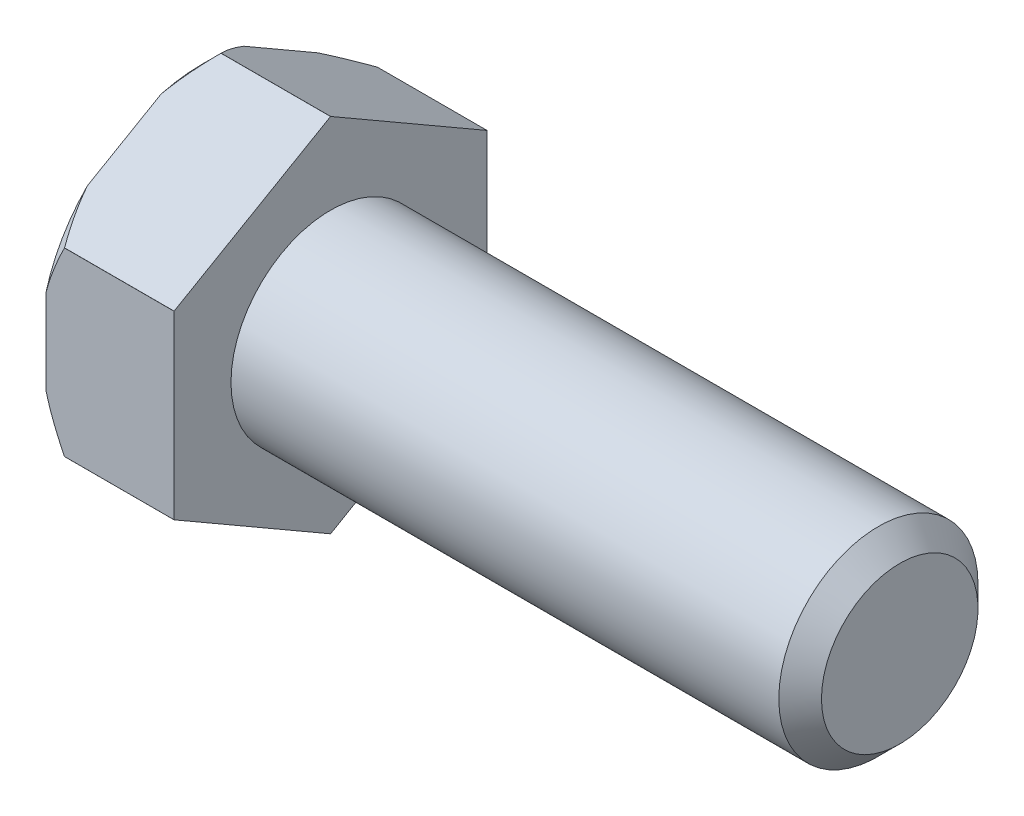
ISO-10303-21;
HEADER;
FILE_DESCRIPTION(('STEP AP214'),'2;1');
FILE_NAME('part.step','',(''),(''),'','','');
FILE_SCHEMA(('AUTOMOTIVE_DESIGN { 1 0 10303 214 1 1 1 1 }'));
ENDSEC;
DATA;
#1=APPLICATION_CONTEXT('core data for automotive mechanical design processes');
#2=APPLICATION_PROTOCOL_DEFINITION('international standard','automotive_design',2000,#1);
#3=PRODUCT_CONTEXT('',#1,'mechanical');
#4=PRODUCT('Part','Part','',(#3));
#5=PRODUCT_RELATED_PRODUCT_CATEGORY('part','',(#4));
#6=PRODUCT_DEFINITION_FORMATION('','',#4);
#7=PRODUCT_DEFINITION_CONTEXT('part definition',#1,'design');
#8=PRODUCT_DEFINITION('design','',#6,#7);
#9=PRODUCT_DEFINITION_SHAPE('','',#8);
#10=(LENGTH_UNIT() NAMED_UNIT(*) SI_UNIT(.MILLI.,.METRE.));
#11=(NAMED_UNIT(*) PLANE_ANGLE_UNIT() SI_UNIT($,.RADIAN.));
#12=(NAMED_UNIT(*) SI_UNIT($,.STERADIAN.) SOLID_ANGLE_UNIT());
#13=UNCERTAINTY_MEASURE_WITH_UNIT(LENGTH_MEASURE(1.E-05),#10,'distance_accuracy_value','');
#14=(GEOMETRIC_REPRESENTATION_CONTEXT(3) GLOBAL_UNCERTAINTY_ASSIGNED_CONTEXT((#13)) GLOBAL_UNIT_ASSIGNED_CONTEXT((#10,
#11,#12)) REPRESENTATION_CONTEXT('',''));
#15=CARTESIAN_POINT('',(0.,0.,0.));
#16=DIRECTION('',(0.,0.,1.));
#17=DIRECTION('',(1.,0.,0.));
#18=AXIS2_PLACEMENT_3D('',#15,#16,#17);
#19=CARTESIAN_POINT('',(-8.99999999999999,0.,0.));
#20=DIRECTION('',(1.,0.,0.));
#21=DIRECTION('',(0.,0.,-1.));
#22=AXIS2_PLACEMENT_3D('',#19,#20,#21);
#23=PLANE('',#22);
#24=DIRECTION('',(0.,-1.,0.));
#25=VECTOR('',#24,1.);
#26=CARTESIAN_POINT('',(-8.99999999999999,6.35085296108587,-11.));
#27=LINE('',#26,#25);
#28=CARTESIAN_POINT('',(-8.99999999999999,2.99332590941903,-11.));
#29=VERTEX_POINT('',#28);
#30=CARTESIAN_POINT('',(-8.99999999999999,-2.99332590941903,-11.));
#31=VERTEX_POINT('',#30);
#32=EDGE_CURVE('E171',#29,#31,#27,.T.);
#33=ORIENTED_EDGE('',*,*,#32,.T.);
#34=CARTESIAN_POINT('',(-8.99999999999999,0.,0.));
#35=DIRECTION('',(1.,0.,0.));
#36=DIRECTION('',(0.,0.,-1.));
#37=AXIS2_PLACEMENT_3D('',#34,#35,#36);
#38=CIRCLE('',#37,11.4);
#39=CARTESIAN_POINT('',(-9.00000000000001,-8.02961648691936,-8.09229627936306));
#40=VERTEX_POINT('',#39);
#41=EDGE_CURVE('E177',#31,#40,#38,.F.);
#42=ORIENTED_EDGE('',*,*,#41,.T.);
#43=DIRECTION('',(0.,-0.5,0.866025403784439));
#44=VECTOR('',#43,1.);
#45=CARTESIAN_POINT('',(-9.00000000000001,-6.3508529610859,-11.));
#46=LINE('',#45,#44);
#47=CARTESIAN_POINT('',(-8.99999999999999,-11.0229423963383,-2.90770372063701));
#48=VERTEX_POINT('',#47);
#49=EDGE_CURVE('E160',#40,#48,#46,.T.);
#50=ORIENTED_EDGE('',*,*,#49,.T.);
#51=CARTESIAN_POINT('',(-8.99999999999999,-11.0229423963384,2.90770372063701));
#52=VERTEX_POINT('',#51);
#53=EDGE_CURVE('E184',#48,#52,#38,.F.);
#54=ORIENTED_EDGE('',*,*,#53,.T.);
#55=DIRECTION('',(0.,0.5,0.866025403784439));
#56=VECTOR('',#55,1.);
#57=CARTESIAN_POINT('',(-8.99999999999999,-12.7017059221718,0.));
#58=LINE('',#57,#56);
#59=CARTESIAN_POINT('',(-8.99999999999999,-8.02961648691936,8.09229627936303));
#60=VERTEX_POINT('',#59);
#61=EDGE_CURVE('E170',#52,#60,#58,.T.);
#62=ORIENTED_EDGE('',*,*,#61,.T.);
#63=CARTESIAN_POINT('',(-8.99999999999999,-2.99332590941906,11.));
#64=VERTEX_POINT('',#63);
#65=EDGE_CURVE('E190',#60,#64,#38,.F.);
#66=ORIENTED_EDGE('',*,*,#65,.T.);
#67=DIRECTION('',(0.,1.,0.));
#68=VECTOR('',#67,1.);
#69=CARTESIAN_POINT('',(-8.99999999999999,6.35085296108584,11.));
#70=LINE('',#69,#68);
#71=CARTESIAN_POINT('',(-8.99999999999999,2.99332590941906,11.));
#72=VERTEX_POINT('',#71);
#73=EDGE_CURVE('E260',#64,#72,#70,.T.);
#74=ORIENTED_EDGE('',*,*,#73,.T.);
#75=CARTESIAN_POINT('',(-8.99999999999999,8.02961648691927,8.09229627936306));
#76=VERTEX_POINT('',#75);
#77=EDGE_CURVE('E197',#72,#76,#38,.F.);
#78=ORIENTED_EDGE('',*,*,#77,.T.);
#79=DIRECTION('',(0.,0.5,-0.866025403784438));
#80=VECTOR('',#79,1.);
#81=CARTESIAN_POINT('',(-8.99999999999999,12.7017059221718,0.));
#82=LINE('',#81,#80);
#83=CARTESIAN_POINT('',(-8.99999999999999,11.0229423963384,2.90770372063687));
#84=VERTEX_POINT('',#83);
#85=EDGE_CURVE('E257',#76,#84,#82,.T.);
#86=ORIENTED_EDGE('',*,*,#85,.T.);
#87=CARTESIAN_POINT('',(-8.99999999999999,11.0229423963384,-2.90770372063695));
#88=VERTEX_POINT('',#87);
#89=EDGE_CURVE('E192',#84,#88,#38,.F.);
#90=ORIENTED_EDGE('',*,*,#89,.T.);
#91=DIRECTION('',(0.,-0.5,-0.866025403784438));
#92=VECTOR('',#91,1.);
#93=CARTESIAN_POINT('',(-8.99999999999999,6.35085296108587,-11.));
#94=LINE('',#93,#92);
#95=CARTESIAN_POINT('',(-8.99999999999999,8.02961648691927,-8.09229627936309));
#96=VERTEX_POINT('',#95);
#97=EDGE_CURVE('E255',#88,#96,#94,.T.);
#98=ORIENTED_EDGE('',*,*,#97,.T.);
#99=EDGE_CURVE('E186',#96,#29,#38,.F.);
#100=ORIENTED_EDGE('',*,*,#99,.T.);
#101=EDGE_LOOP('',(#33,#42,#50,#54,#62,#66,#74,#78,#86,#90,#98,#100));
#102=FACE_BOUND('',#101,.T.);
#103=ADVANCED_FACE('F33',(#102),#23,.F.);
#104=CARTESIAN_POINT('',(-49.2334801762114,0.,0.));
#105=DIRECTION('',(-1.,0.,0.));
#106=DIRECTION('',(0.,0.,1.));
#107=AXIS2_PLACEMENT_3D('',#104,#105,#106);
#108=CYLINDRICAL_SURFACE('',#107,12.7);
#109=DIRECTION('',(-1.,0.,0.));
#110=VECTOR('',#109,1.);
#111=CARTESIAN_POINT('',(-49.2334801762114,-6.34744042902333,-11.));
#112=LINE('',#111,#110);
#113=CARTESIAN_POINT('',(0.,-6.3474404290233,-11.));
#114=VERTEX_POINT('',#113);
#115=CARTESIAN_POINT('',(-7.7,-6.3474404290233,-11.));
#116=VERTEX_POINT('',#115);
#117=EDGE_CURVE('E52',#114,#116,#112,.T.);
#118=ORIENTED_EDGE('',*,*,#117,.F.);
#119=CARTESIAN_POINT('',(0.,0.,0.));
#120=DIRECTION('',(-1.,0.,0.));
#121=DIRECTION('',(0.,0.,1.));
#122=AXIS2_PLACEMENT_3D('',#119,#120,#121);
#123=CIRCLE('',#122,12.7);
#124=CARTESIAN_POINT('',(0.,-6.35255922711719,-10.9970446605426));
#125=VERTEX_POINT('',#124);
#126=EDGE_CURVE('E216',#114,#125,#123,.T.);
#127=ORIENTED_EDGE('',*,*,#126,.T.);
#128=DIRECTION('',(-1.,0.,0.));
#129=VECTOR('',#128,1.);
#130=CARTESIAN_POINT('',(-49.2334801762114,-6.35255922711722,-10.9970446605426));
#131=LINE('',#130,#129);
#132=CARTESIAN_POINT('',(-7.7,-6.35255922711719,-10.9970446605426));
#133=VERTEX_POINT('',#132);
#134=EDGE_CURVE('E250',#133,#125,#131,.F.);
#135=ORIENTED_EDGE('',*,*,#134,.F.);
#136=CARTESIAN_POINT('',(-7.7,0.,0.));
#137=DIRECTION('',(1.,0.,0.));
#138=DIRECTION('',(0.,0.,-1.));
#139=AXIS2_PLACEMENT_3D('',#136,#137,#138);
#140=CIRCLE('',#139,12.7);
#141=EDGE_CURVE('E179',#133,#116,#140,.T.);
#142=ORIENTED_EDGE('',*,*,#141,.T.);
#143=EDGE_LOOP('',(#118,#127,#135,#142));
#144=FACE_BOUND('',#143,.T.);
#145=ADVANCED_FACE('F366',(#144),#108,.T.);
#146=DIRECTION('',(-1.,0.,0.));
#147=VECTOR('',#146,1.);
#148=CARTESIAN_POINT('',(-49.2334801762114,6.3474404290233,-11.));
#149=LINE('',#148,#147);
#150=CARTESIAN_POINT('',(-7.7,6.3474404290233,-11.));
#151=VERTEX_POINT('',#150);
#152=CARTESIAN_POINT('',(0.,6.3474404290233,-11.));
#153=VERTEX_POINT('',#152);
#154=EDGE_CURVE('E218',#151,#153,#149,.F.);
#155=ORIENTED_EDGE('',*,*,#154,.F.);
#156=CARTESIAN_POINT('',(-7.7,6.35255922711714,-10.9970446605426));
#157=VERTEX_POINT('',#156);
#158=EDGE_CURVE('E189',#151,#157,#140,.T.);
#159=ORIENTED_EDGE('',*,*,#158,.T.);
#160=DIRECTION('',(-1.,0.,0.));
#161=VECTOR('',#160,1.);
#162=CARTESIAN_POINT('',(-49.2334801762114,6.35255922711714,-10.9970446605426));
#163=LINE('',#162,#161);
#164=CARTESIAN_POINT('',(0.,6.35255922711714,-10.9970446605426));
#165=VERTEX_POINT('',#164);
#166=EDGE_CURVE('E230',#165,#157,#163,.T.);
#167=ORIENTED_EDGE('',*,*,#166,.F.);
#168=EDGE_CURVE('E206',#165,#153,#123,.T.);
#169=ORIENTED_EDGE('',*,*,#168,.T.);
#170=EDGE_LOOP('',(#155,#159,#167,#169));
#171=FACE_BOUND('',#170,.T.);
#172=ADVANCED_FACE('F370',(#171),#108,.T.);
#173=DIRECTION('',(-1.,0.,0.));
#174=VECTOR('',#173,1.);
#175=CARTESIAN_POINT('',(-49.2334801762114,12.6999996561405,-0.00295533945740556));
#176=LINE('',#175,#174);
#177=CARTESIAN_POINT('',(-7.69999999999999,12.6999996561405,-0.00295533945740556));
#178=VERTEX_POINT('',#177);
#179=CARTESIAN_POINT('',(0.,12.7,-0.0029547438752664));
#180=VERTEX_POINT('',#179);
#181=EDGE_CURVE('E226',#178,#180,#176,.F.);
#182=ORIENTED_EDGE('',*,*,#181,.F.);
#183=CARTESIAN_POINT('',(-7.69999999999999,12.6999996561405,0.0029553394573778));
#184=VERTEX_POINT('',#183);
#185=EDGE_CURVE('E399',#178,#184,#140,.T.);
#186=ORIENTED_EDGE('',*,*,#185,.T.);
#187=DIRECTION('',(-1.,0.,0.));
#188=VECTOR('',#187,1.);
#189=CARTESIAN_POINT('',(-49.2334801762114,12.6999996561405,0.0029553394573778));
#190=LINE('',#189,#188);
#191=CARTESIAN_POINT('',(0.,12.6999996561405,0.0029553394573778));
#192=VERTEX_POINT('',#191);
#193=EDGE_CURVE('E236',#192,#184,#190,.T.);
#194=ORIENTED_EDGE('',*,*,#193,.F.);
#195=EDGE_CURVE('E199',#192,#180,#123,.T.);
#196=ORIENTED_EDGE('',*,*,#195,.T.);
#197=EDGE_LOOP('',(#182,#186,#194,#196));
#198=FACE_BOUND('',#197,.T.);
#199=ADVANCED_FACE('F376',(#198),#108,.T.);
#200=DIRECTION('',(-1.,0.,0.));
#201=VECTOR('',#200,1.);
#202=CARTESIAN_POINT('',(-49.2334801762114,6.35255922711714,10.9970446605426));
#203=LINE('',#202,#201);
#204=CARTESIAN_POINT('',(-7.69999999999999,6.35255922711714,10.9970446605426));
#205=VERTEX_POINT('',#204);
#206=CARTESIAN_POINT('',(0.,6.35255922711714,10.9970446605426));
#207=VERTEX_POINT('',#206);
#208=EDGE_CURVE('E232',#205,#207,#203,.F.);
#209=ORIENTED_EDGE('',*,*,#208,.F.);
#210=CARTESIAN_POINT('',(-7.69999999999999,6.34744042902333,11.));
#211=VERTEX_POINT('',#210);
#212=EDGE_CURVE('E287',#205,#211,#140,.T.);
#213=ORIENTED_EDGE('',*,*,#212,.T.);
#214=DIRECTION('',(-1.,0.,0.));
#215=VECTOR('',#214,1.);
#216=CARTESIAN_POINT('',(-49.2334801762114,6.34744042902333,11.));
#217=LINE('',#216,#215);
#218=CARTESIAN_POINT('',(0.,6.34744042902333,11.));
#219=VERTEX_POINT('',#218);
#220=EDGE_CURVE('E242',#219,#211,#217,.T.);
#221=ORIENTED_EDGE('',*,*,#220,.F.);
#222=EDGE_CURVE('E193',#219,#207,#123,.T.);
#223=ORIENTED_EDGE('',*,*,#222,.T.);
#224=EDGE_LOOP('',(#209,#213,#221,#223));
#225=FACE_BOUND('',#224,.T.);
#226=ADVANCED_FACE('F387',(#225),#108,.T.);
#227=DIRECTION('',(-1.,0.,0.));
#228=VECTOR('',#227,1.);
#229=CARTESIAN_POINT('',(-49.2334801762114,-6.34744042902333,11.));
#230=LINE('',#229,#228);
#231=CARTESIAN_POINT('',(-7.69999999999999,-6.3474404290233,11.));
#232=VERTEX_POINT('',#231);
#233=CARTESIAN_POINT('',(0.,-6.3474404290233,11.));
#234=VERTEX_POINT('',#233);
#235=EDGE_CURVE('E238',#232,#234,#230,.F.);
#236=ORIENTED_EDGE('',*,*,#235,.F.);
#237=CARTESIAN_POINT('',(-7.69999999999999,-6.35255922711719,10.9970446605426));
#238=VERTEX_POINT('',#237);
#239=EDGE_CURVE('E395',#232,#238,#140,.T.);
#240=ORIENTED_EDGE('',*,*,#239,.T.);
#241=DIRECTION('',(-1.,0.,0.));
#242=VECTOR('',#241,1.);
#243=CARTESIAN_POINT('',(-49.2334801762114,-6.35255922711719,10.9970446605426));
#244=LINE('',#243,#242);
#245=CARTESIAN_POINT('',(0.,-6.35255922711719,10.9970446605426));
#246=VERTEX_POINT('',#245);
#247=EDGE_CURVE('E248',#246,#238,#244,.T.);
#248=ORIENTED_EDGE('',*,*,#247,.F.);
#249=EDGE_CURVE('E200',#246,#234,#123,.T.);
#250=ORIENTED_EDGE('',*,*,#249,.T.);
#251=EDGE_LOOP('',(#236,#240,#248,#250));
#252=FACE_BOUND('',#251,.T.);
#253=ADVANCED_FACE('F381',(#252),#108,.T.);
#254=DIRECTION('',(-1.,0.,0.));
#255=VECTOR('',#254,1.);
#256=CARTESIAN_POINT('',(-49.2334801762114,-12.6999996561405,0.00295533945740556));
#257=LINE('',#256,#255);
#258=CARTESIAN_POINT('',(-7.7,-12.6999996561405,0.00295533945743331));
#259=VERTEX_POINT('',#258);
#260=CARTESIAN_POINT('',(0.,-12.7,0.00295474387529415));
#261=VERTEX_POINT('',#260);
#262=EDGE_CURVE('E244',#259,#261,#257,.F.);
#263=ORIENTED_EDGE('',*,*,#262,.F.);
#264=CARTESIAN_POINT('',(-7.7,-12.6999996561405,-0.00295533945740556));
#265=VERTEX_POINT('',#264);
#266=EDGE_CURVE('E187',#259,#265,#140,.T.);
#267=ORIENTED_EDGE('',*,*,#266,.T.);
#268=DIRECTION('',(-1.,0.,0.));
#269=VECTOR('',#268,1.);
#270=CARTESIAN_POINT('',(-49.2334801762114,-12.6999996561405,-0.00295533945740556));
#271=LINE('',#270,#269);
#272=CARTESIAN_POINT('',(0.,-12.6999996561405,-0.00295533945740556));
#273=VERTEX_POINT('',#272);
#274=EDGE_CURVE('E60',#273,#265,#271,.T.);
#275=ORIENTED_EDGE('',*,*,#274,.F.);
#276=EDGE_CURVE('E209',#273,#261,#123,.T.);
#277=ORIENTED_EDGE('',*,*,#276,.T.);
#278=EDGE_LOOP('',(#263,#267,#275,#277));
#279=FACE_BOUND('',#278,.T.);
#280=ADVANCED_FACE('F372',(#279),#108,.T.);
#281=CARTESIAN_POINT('',(0.,12.7,0.));
#282=DIRECTION('',(-1.,0.,0.));
#283=DIRECTION('',(0.,0.,1.));
#284=AXIS2_PLACEMENT_3D('',#281,#282,#283);
#285=PLANE('',#284);
#286=CARTESIAN_POINT('',(0.,0.,0.));
#287=DIRECTION('',(-1.,0.,0.));
#288=DIRECTION('',(0.,0.,1.));
#289=AXIS2_PLACEMENT_3D('',#286,#287,#288);
#290=CIRCLE('',#289,7.);
#291=CARTESIAN_POINT('',(0.,0.,7.));
#292=VERTEX_POINT('',#291);
#293=EDGE_CURVE('E210',#292,#292,#290,.T.);
#294=ORIENTED_EDGE('',*,*,#293,.T.);
#295=EDGE_LOOP('',(#294));
#296=FACE_BOUND('',#295,.T.);
#297=DIRECTION('',(0.,-1.,0.));
#298=VECTOR('',#297,1.);
#299=CARTESIAN_POINT('',(0.,12.7,-11.));
#300=LINE('',#299,#298);
#301=EDGE_CURVE('E221',#153,#114,#300,.T.);
#302=ORIENTED_EDGE('',*,*,#301,.F.);
#303=ORIENTED_EDGE('',*,*,#168,.F.);
#304=DIRECTION('',(0.,-0.5,-0.866025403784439));
#305=VECTOR('',#304,1.);
#306=CARTESIAN_POINT('',(0.,12.7012794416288,-0.00073868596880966));
#307=LINE('',#306,#305);
#308=EDGE_CURVE('E228',#180,#165,#307,.T.);
#309=ORIENTED_EDGE('',*,*,#308,.F.);
#310=ORIENTED_EDGE('',*,*,#195,.F.);
#311=DIRECTION('',(0.,0.5,-0.866025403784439));
#312=VECTOR('',#311,1.);
#313=CARTESIAN_POINT('',(0.,12.7012794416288,0.00073868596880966));
#314=LINE('',#313,#312);
#315=EDGE_CURVE('E234',#207,#192,#314,.T.);
#316=ORIENTED_EDGE('',*,*,#315,.F.);
#317=ORIENTED_EDGE('',*,*,#222,.F.);
#318=DIRECTION('',(0.,1.,0.));
#319=VECTOR('',#318,1.);
#320=CARTESIAN_POINT('',(0.,12.7,11.));
#321=LINE('',#320,#319);
#322=EDGE_CURVE('E240',#234,#219,#321,.T.);
#323=ORIENTED_EDGE('',*,*,#322,.F.);
#324=ORIENTED_EDGE('',*,*,#249,.F.);
#325=DIRECTION('',(0.,0.5,0.866025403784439));
#326=VECTOR('',#325,1.);
#327=CARTESIAN_POINT('',(0.,-6.35127944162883,10.9992613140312));
#328=LINE('',#327,#326);
#329=EDGE_CURVE('E246',#261,#246,#328,.T.);
#330=ORIENTED_EDGE('',*,*,#329,.F.);
#331=ORIENTED_EDGE('',*,*,#276,.F.);
#332=DIRECTION('',(0.,-0.5,0.866025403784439));
#333=VECTOR('',#332,1.);
#334=CARTESIAN_POINT('',(0.,-6.35127944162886,-10.9992613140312));
#335=LINE('',#334,#333);
#336=EDGE_CURVE('E252',#125,#273,#335,.T.);
#337=ORIENTED_EDGE('',*,*,#336,.F.);
#338=ORIENTED_EDGE('',*,*,#126,.F.);
#339=EDGE_LOOP('',(#302,#303,#309,#310,#316,#317,#323,#324,#330,#331,#337,#338));
#340=FACE_BOUND('',#339,.T.);
#341=ADVANCED_FACE('F380',(#296,#340),#285,.F.);
#342=CARTESIAN_POINT('',(-8.99999999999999,0.,0.));
#343=DIRECTION('',(1.,0.,0.));
#344=DIRECTION('',(0.,0.,-1.));
#345=AXIS2_PLACEMENT_3D('',#342,#343,#344);
#346=CONICAL_SURFACE('',#345,11.4,0.785398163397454);
#347=ORIENTED_EDGE('',*,*,#158,.F.);
#348=CARTESIAN_POINT('',(-3.0517042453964,-13.4150425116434,-11.));
#349=CARTESIAN_POINT('',(-3.30179493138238,-13.0915535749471,-11.));
#350=CARTESIAN_POINT('',(-3.54968964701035,-12.7663400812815,-11.));
#351=CARTESIAN_POINT('',(-4.04007857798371,-12.1117525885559,-11.));
#352=CARTESIAN_POINT('',(-4.28257152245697,-11.7823776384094,-11.));
#353=CARTESIAN_POINT('',(-4.76287329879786,-11.1163510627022,-11.));
#354=CARTESIAN_POINT('',(-5.00063167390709,-10.7796629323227,-11.));
#355=CARTESIAN_POINT('',(-5.46802813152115,-10.1007153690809,-11.));
#356=CARTESIAN_POINT('',(-5.69766676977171,-9.75845631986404,-11.));
#357=CARTESIAN_POINT('',(-6.16159778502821,-9.04490686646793,-11.));
#358=CARTESIAN_POINT('',(-6.3952187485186,-8.67317773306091,-11.));
#359=CARTESIAN_POINT('',(-6.84818351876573,-7.92098023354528,-11.));
#360=CARTESIAN_POINT('',(-7.0675248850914,-7.54051038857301,-11.));
#361=CARTESIAN_POINT('',(-7.487276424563,-6.77068995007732,-11.));
#362=CARTESIAN_POINT('',(-7.68774211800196,-6.38136986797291,-11.));
#363=CARTESIAN_POINT('',(-8.06525043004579,-5.59162400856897,-11.));
#364=CARTESIAN_POINT('',(-8.24230421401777,-5.19120363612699,-11.));
#365=CARTESIAN_POINT('',(-8.54979272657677,-4.42029544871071,-11.));
#366=CARTESIAN_POINT('',(-8.68315354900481,-4.05098669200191,-11.));
#367=CARTESIAN_POINT('',(-8.92032714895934,-3.30282237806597,-11.));
#368=CARTESIAN_POINT('',(-9.02413808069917,-2.92396622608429,-11.));
#369=CARTESIAN_POINT('',(-9.19480449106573,-2.16565202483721,-11.));
#370=CARTESIAN_POINT('',(-9.26234174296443,-1.78635006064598,-11.));
#371=CARTESIAN_POINT('',(-9.35902789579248,-1.0228570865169,-11.));
#372=CARTESIAN_POINT('',(-9.38818516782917,-0.638667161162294,-11.));
#373=CARTESIAN_POINT('',(-9.40554235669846,0.112991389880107,-11.));
#374=CARTESIAN_POINT('',(-9.3955603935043,0.480418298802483,-11.));
#375=CARTESIAN_POINT('',(-9.33940181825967,1.21247644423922,-11.));
#376=CARTESIAN_POINT('',(-9.29322198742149,1.57710742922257,-11.));
#377=CARTESIAN_POINT('',(-9.16651887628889,2.30712037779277,-11.));
#378=CARTESIAN_POINT('',(-9.08538316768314,2.67239420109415,-11.));
#379=CARTESIAN_POINT('',(-8.89331739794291,3.3948710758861,-11.));
#380=CARTESIAN_POINT('',(-8.78238880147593,3.75207452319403,-11.));
#381=CARTESIAN_POINT('',(-8.52965120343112,4.47498666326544,-11.));
#382=CARTESIAN_POINT('',(-8.38659525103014,4.84025426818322,-11.));
#383=CARTESIAN_POINT('',(-8.07835437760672,5.56141274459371,-11.));
#384=CARTESIAN_POINT('',(-7.91315955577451,5.91729933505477,-11.));
#385=CARTESIAN_POINT('',(-7.56455636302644,6.62136375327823,-11.));
#386=CARTESIAN_POINT('',(-7.38109216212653,6.96951371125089,-11.));
#387=CARTESIAN_POINT('',(-6.99998347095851,7.65784301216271,-11.));
#388=CARTESIAN_POINT('',(-6.80234114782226,7.99802356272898,-11.));
#389=CARTESIAN_POINT('',(-6.4056692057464,8.65484618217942,-11.));
#390=CARTESIAN_POINT('',(-6.20718878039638,8.9718216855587,-11.));
#391=CARTESIAN_POINT('',(-5.80175920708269,9.60032617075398,-11.));
#392=CARTESIAN_POINT('',(-5.59480942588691,9.91185474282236,-11.));
#393=CARTESIAN_POINT('',(-5.1756298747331,10.5276784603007,-11.));
#394=CARTESIAN_POINT('',(-4.96345565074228,10.832011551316,-11.));
#395=CARTESIAN_POINT('',(-4.53340410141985,11.4364996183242,-11.));
#396=CARTESIAN_POINT('',(-4.31552836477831,11.7366557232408,-11.));
#397=CARTESIAN_POINT('',(-4.09531829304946,12.0350590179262,-11.));
#398=B_SPLINE_CURVE_WITH_KNOTS('',3,(#348,#349,#350,#351,#352,#353,#354,#355,#356,#357,#358,
#359,#360,#361,#362,#363,#364,#365,#366,#367,#368,#369,#370,#371,#372,#373,#374,#375,#376,#377,
#378,#379,#380,#381,#382,#383,#384,#385,#386,#387,#388,#389,#390,#391,#392,#393,#394,#395,#396,
#397),.UNSPECIFIED.,.F.,.F.,(4,2,2,2,2,2,2,2,2,2,2,2,2,2,2,2,2,2,2,2,2,2,2,2,4),(0.,
1.22668988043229,2.45366537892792,3.69009029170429,4.92643041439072,6.24331311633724,
7.56042029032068,8.87352371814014,10.1859986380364,11.36293842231,12.5399517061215,
13.6939911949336,14.8477789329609,15.9486196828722,17.0495583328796,18.1706242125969,
19.2916349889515,20.4675837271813,21.6440601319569,22.8242490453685,24.0042579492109,
25.1260679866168,26.2479620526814,27.3608729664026,28.4734770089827),.UNSPECIFIED.);
#399=EDGE_CURVE('E11',#151,#29,#398,.F.);
#400=ORIENTED_EDGE('',*,*,#399,.T.);
#401=ORIENTED_EDGE('',*,*,#99,.F.);
#402=CARTESIAN_POINT('',(-9.00019999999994,8.02999737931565,-8.09163655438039));
#403=CARTESIAN_POINT('',(-8.92378584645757,7.88444285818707,-8.34374438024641));
#404=CARTESIAN_POINT('',(-8.83768625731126,7.74023735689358,-8.59351563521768));
#405=CARTESIAN_POINT('',(-8.6488792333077,7.45498341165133,-9.08758996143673));
#406=CARTESIAN_POINT('',(-8.54621652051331,7.31392759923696,-9.33190579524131));
#407=CARTESIAN_POINT('',(-8.32666581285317,7.03472440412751,-9.81549991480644));
#408=CARTESIAN_POINT('',(-8.20978460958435,6.89657566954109,-10.0547805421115));
#409=CARTESIAN_POINT('',(-7.96356456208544,6.62263138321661,-10.5292659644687));
#410=CARTESIAN_POINT('',(-7.83419338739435,6.48684307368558,-10.7644582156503));
#411=CARTESIAN_POINT('',(-7.69979999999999,6.35235915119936,-10.9973912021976));
#412=B_SPLINE_CURVE_WITH_KNOTS('',3,(#402,#403,#404,#405,#406,#407,#408,#409,#410,#411),
.UNSPECIFIED.,.F.,.F.,(4,2,2,2,4),(0.,0.902530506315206,1.802663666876,2.70236854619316,
3.60446817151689),.UNSPECIFIED.);
#413=EDGE_CURVE('E289',#96,#157,#412,.T.);
#414=ORIENTED_EDGE('',*,*,#413,.T.);
#415=EDGE_LOOP('',(#347,#400,#401,#414));
#416=FACE_BOUND('',#415,.T.);
#417=ADVANCED_FACE('F309',(#416),#346,.T.);
#418=ORIENTED_EDGE('',*,*,#41,.F.);
#419=EDGE_CURVE('E36',#31,#116,#398,.F.);
#420=ORIENTED_EDGE('',*,*,#419,.T.);
#421=ORIENTED_EDGE('',*,*,#141,.F.);
#422=CARTESIAN_POINT('',(-7.69979999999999,-6.35235915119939,-10.9973912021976));
#423=CARTESIAN_POINT('',(-7.83419338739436,-6.48684307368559,-10.7644582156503));
#424=CARTESIAN_POINT('',(-7.96356456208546,-6.62263138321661,-10.5292659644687));
#425=CARTESIAN_POINT('',(-8.20978460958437,-6.89657566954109,-10.0547805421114));
#426=CARTESIAN_POINT('',(-8.3266658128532,-7.03472440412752,-9.8154999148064));
#427=CARTESIAN_POINT('',(-8.54621652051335,-7.31392759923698,-9.33190579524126));
#428=CARTESIAN_POINT('',(-8.64887923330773,-7.45498341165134,-9.08758996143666));
#429=CARTESIAN_POINT('',(-8.83768625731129,-7.7402373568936,-8.5935156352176));
#430=CARTESIAN_POINT('',(-8.92378584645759,-7.88444285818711,-8.34374438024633));
#431=CARTESIAN_POINT('',(-9.00019999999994,-8.0299973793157,-8.0916365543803));
#432=B_SPLINE_CURVE_WITH_KNOTS('',3,(#422,#423,#424,#425,#426,#427,#428,#429,#430,#431),
.UNSPECIFIED.,.F.,.F.,(4,2,2,2,4),(0.,0.902099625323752,1.80180450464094,2.70193766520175,
3.60446817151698),.UNSPECIFIED.);
#433=EDGE_CURVE('E163',#133,#40,#432,.T.);
#434=ORIENTED_EDGE('',*,*,#433,.T.);
#435=EDGE_LOOP('',(#418,#420,#421,#434));
#436=FACE_BOUND('',#435,.T.);
#437=ADVANCED_FACE('F176',(#436),#346,.T.);
#438=ORIENTED_EDGE('',*,*,#185,.F.);
#439=CARTESIAN_POINT('',(-7.69979999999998,12.7001997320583,-0.00260879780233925));
#440=CARTESIAN_POINT('',(-7.83419338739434,12.5657158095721,-0.235541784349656));
#441=CARTESIAN_POINT('',(-7.96356456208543,12.4299275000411,-0.470734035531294));
#442=CARTESIAN_POINT('',(-8.20978460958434,12.1559832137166,-0.945219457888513));
#443=CARTESIAN_POINT('',(-8.32666581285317,12.0178344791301,-1.18450008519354));
#444=CARTESIAN_POINT('',(-8.54621652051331,11.7386312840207,-1.66809420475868));
#445=CARTESIAN_POINT('',(-8.64887923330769,11.5975754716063,-1.91241003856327));
#446=CARTESIAN_POINT('',(-8.83768625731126,11.3123215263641,-2.40648436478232));
#447=CARTESIAN_POINT('',(-8.92378584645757,11.1681160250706,-2.65625561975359));
#448=CARTESIAN_POINT('',(-9.00019999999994,11.022561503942,-2.90836344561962));
#449=B_SPLINE_CURVE_WITH_KNOTS('',3,(#439,#440,#441,#442,#443,#444,#445,#446,#447,#448),
.UNSPECIFIED.,.F.,.F.,(4,2,2,2,4),(0.,0.902099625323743,1.80180450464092,2.70193766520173,
3.60446817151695),.UNSPECIFIED.);
#450=EDGE_CURVE('E293',#178,#88,#449,.T.);
#451=ORIENTED_EDGE('',*,*,#450,.T.);
#452=ORIENTED_EDGE('',*,*,#89,.F.);
#453=CARTESIAN_POINT('',(-9.0002,11.0225615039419,2.90836344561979));
#454=CARTESIAN_POINT('',(-8.9237858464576,11.1681160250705,2.65625561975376));
#455=CARTESIAN_POINT('',(-8.83768625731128,11.312321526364,2.40648436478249));
#456=CARTESIAN_POINT('',(-8.64887923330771,11.5975754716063,1.91241003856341));
#457=CARTESIAN_POINT('',(-8.54621652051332,11.7386312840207,1.66809420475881));
#458=CARTESIAN_POINT('',(-8.32666581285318,12.0178344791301,1.18450008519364));
#459=CARTESIAN_POINT('',(-8.20978460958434,12.1559832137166,0.945219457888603));
#460=CARTESIAN_POINT('',(-7.96356456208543,12.4299275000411,0.470734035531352));
#461=CARTESIAN_POINT('',(-7.83419338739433,12.5657158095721,0.235541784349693));
#462=CARTESIAN_POINT('',(-7.69979999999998,12.7001997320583,0.00260879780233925));
#463=B_SPLINE_CURVE_WITH_KNOTS('',3,(#453,#454,#455,#456,#457,#458,#459,#460,#461,#462),
.UNSPECIFIED.,.F.,.F.,(4,2,2,2,4),(0.,0.902530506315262,1.80266366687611,2.70236854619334,
3.60446817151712),.UNSPECIFIED.);
#464=EDGE_CURVE('E290',#84,#184,#463,.T.);
#465=ORIENTED_EDGE('',*,*,#464,.T.);
#466=EDGE_LOOP('',(#438,#451,#452,#465));
#467=FACE_BOUND('',#466,.T.);
#468=ADVANCED_FACE('F419',(#467),#346,.T.);
#469=ORIENTED_EDGE('',*,*,#212,.F.);
#470=CARTESIAN_POINT('',(-7.69979999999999,6.35235915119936,10.9973912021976));
#471=CARTESIAN_POINT('',(-7.83419338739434,6.48684307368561,10.7644582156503));
#472=CARTESIAN_POINT('',(-7.96356456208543,6.62263138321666,10.5292659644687));
#473=CARTESIAN_POINT('',(-8.20978460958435,6.89657566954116,10.0547805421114));
#474=CARTESIAN_POINT('',(-8.32666581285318,7.03472440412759,9.81549991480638));
#475=CARTESIAN_POINT('',(-8.54621652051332,7.31392759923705,9.33190579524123));
#476=CARTESIAN_POINT('',(-8.64887923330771,7.45498341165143,9.08758996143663));
#477=CARTESIAN_POINT('',(-8.83768625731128,7.74023735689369,8.59351563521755));
#478=CARTESIAN_POINT('',(-8.9237858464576,7.88444285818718,8.34374438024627));
#479=CARTESIAN_POINT('',(-9.0002,8.02999737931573,8.09163655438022));
#480=B_SPLINE_CURVE_WITH_KNOTS('',3,(#470,#471,#472,#473,#474,#475,#476,#477,#478,#479),
.UNSPECIFIED.,.F.,.F.,(4,2,2,2,4),(0.,0.902099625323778,1.80180450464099,2.70193766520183,
3.60446817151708),.UNSPECIFIED.);
#481=EDGE_CURVE('E286',#205,#76,#480,.T.);
#482=ORIENTED_EDGE('',*,*,#481,.T.);
#483=ORIENTED_EDGE('',*,*,#77,.F.);
#484=CARTESIAN_POINT('',(-3.05170424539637,-13.4150425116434,11.));
#485=CARTESIAN_POINT('',(-3.30179493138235,-13.0915535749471,11.));
#486=CARTESIAN_POINT('',(-3.54968964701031,-12.7663400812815,11.0000000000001));
#487=CARTESIAN_POINT('',(-4.04007857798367,-12.1117525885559,11.0000000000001));
#488=CARTESIAN_POINT('',(-4.28257152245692,-11.7823776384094,11.0000000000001));
#489=CARTESIAN_POINT('',(-4.76287329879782,-11.1163510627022,11.0000000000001));
#490=CARTESIAN_POINT('',(-5.00063167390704,-10.7796629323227,11.0000000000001));
#491=CARTESIAN_POINT('',(-5.46802813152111,-10.1007153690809,11.0000000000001));
#492=CARTESIAN_POINT('',(-5.69766676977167,-9.75845631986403,11.0000000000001));
#493=CARTESIAN_POINT('',(-6.16159778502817,-9.04490686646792,11.0000000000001));
#494=CARTESIAN_POINT('',(-6.39521874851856,-8.6731777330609,11.0000000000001));
#495=CARTESIAN_POINT('',(-6.84818351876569,-7.92098023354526,11.0000000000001));
#496=CARTESIAN_POINT('',(-7.06752488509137,-7.54051038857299,11.0000000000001));
#497=CARTESIAN_POINT('',(-7.48727642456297,-6.77068995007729,11.0000000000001));
#498=CARTESIAN_POINT('',(-7.68774211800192,-6.38136986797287,11.0000000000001));
#499=CARTESIAN_POINT('',(-8.06525043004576,-5.59162400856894,11.));
#500=CARTESIAN_POINT('',(-8.24230421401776,-5.19120363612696,11.));
#501=CARTESIAN_POINT('',(-8.54979272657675,-4.42029544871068,11.));
#502=CARTESIAN_POINT('',(-8.68315354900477,-4.05098669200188,11.));
#503=CARTESIAN_POINT('',(-8.9203271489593,-3.30282237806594,11.0000000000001));
#504=CARTESIAN_POINT('',(-9.02413808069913,-2.92396622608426,11.0000000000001));
#505=CARTESIAN_POINT('',(-9.19480449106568,-2.16565202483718,11.0000000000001));
#506=CARTESIAN_POINT('',(-9.26234174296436,-1.78635006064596,11.0000000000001));
#507=CARTESIAN_POINT('',(-9.35902789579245,-1.02285708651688,11.));
#508=CARTESIAN_POINT('',(-9.38818516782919,-0.638667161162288,11.));
#509=CARTESIAN_POINT('',(-9.40554235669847,0.112991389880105,11.));
#510=CARTESIAN_POINT('',(-9.39556039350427,0.480418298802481,11.));
#511=CARTESIAN_POINT('',(-9.33940181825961,1.21247644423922,11.0000000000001));
#512=CARTESIAN_POINT('',(-9.29322198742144,1.57710742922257,11.));
#513=CARTESIAN_POINT('',(-9.16651887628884,2.30712037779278,11.));
#514=CARTESIAN_POINT('',(-9.08538316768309,2.67239420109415,11.0000000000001));
#515=CARTESIAN_POINT('',(-8.89331739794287,3.39487107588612,11.));
#516=CARTESIAN_POINT('',(-8.78238880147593,3.75207452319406,11.));
#517=CARTESIAN_POINT('',(-8.52965120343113,4.47498666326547,11.));
#518=CARTESIAN_POINT('',(-8.38659525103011,4.84025426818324,11.));
#519=CARTESIAN_POINT('',(-8.07835437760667,5.56141274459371,11.0000000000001));
#520=CARTESIAN_POINT('',(-7.91315955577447,5.91729933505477,11.));
#521=CARTESIAN_POINT('',(-7.56455636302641,6.62136375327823,11.));
#522=CARTESIAN_POINT('',(-7.3810921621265,6.96951371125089,11.));
#523=CARTESIAN_POINT('',(-6.99998347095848,7.65784301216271,11.));
#524=CARTESIAN_POINT('',(-6.80234114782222,7.99802356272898,11.));
#525=CARTESIAN_POINT('',(-6.40566920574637,8.65484618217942,11.));
#526=CARTESIAN_POINT('',(-6.20718878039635,8.9718216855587,11.));
#527=CARTESIAN_POINT('',(-5.80175920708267,9.60032617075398,11.));
#528=CARTESIAN_POINT('',(-5.59480942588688,9.91185474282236,11.));
#529=CARTESIAN_POINT('',(-5.17562987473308,10.5276784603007,11.));
#530=CARTESIAN_POINT('',(-4.96345565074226,10.832011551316,11.));
#531=CARTESIAN_POINT('',(-4.53340410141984,11.4364996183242,11.));
#532=CARTESIAN_POINT('',(-4.3155283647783,11.7366557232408,11.));
#533=CARTESIAN_POINT('',(-4.09531829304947,12.0350590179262,11.));
#534=B_SPLINE_CURVE_WITH_KNOTS('',3,(#484,#485,#486,#487,#488,#489,#490,#491,#492,#493,#494,
#495,#496,#497,#498,#499,#500,#501,#502,#503,#504,#505,#506,#507,#508,#509,#510,#511,#512,#513,
#514,#515,#516,#517,#518,#519,#520,#521,#522,#523,#524,#525,#526,#527,#528,#529,#530,#531,#532,
#533),.UNSPECIFIED.,.F.,.F.,(4,2,2,2,2,2,2,2,2,2,2,2,2,2,2,2,2,2,2,2,2,2,2,2,4),(0.,
1.22668988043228,2.45366537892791,3.69009029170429,4.92643041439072,6.24331311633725,
7.5604202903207,8.87352371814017,10.1859986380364,11.36293842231,12.5399517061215,
13.6939911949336,14.8477789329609,15.9486196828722,17.0495583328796,18.1706242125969,
19.2916349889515,20.4675837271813,21.6440601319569,22.8242490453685,24.0042579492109,
25.1260679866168,26.2479620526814,27.3608729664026,28.4734770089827),.UNSPECIFIED.);
#535=EDGE_CURVE('E284',#72,#211,#534,.T.);
#536=ORIENTED_EDGE('',*,*,#535,.T.);
#537=EDGE_LOOP('',(#469,#482,#483,#536));
#538=FACE_BOUND('',#537,.T.);
#539=ADVANCED_FACE('F283',(#538),#346,.T.);
#540=ORIENTED_EDGE('',*,*,#239,.F.);
#541=EDGE_CURVE('E275',#232,#64,#534,.T.);
#542=ORIENTED_EDGE('',*,*,#541,.T.);
#543=ORIENTED_EDGE('',*,*,#65,.F.);
#544=CARTESIAN_POINT('',(-9.0002,-8.02999737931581,8.09163655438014));
#545=CARTESIAN_POINT('',(-8.92378584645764,-7.88444285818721,8.34374438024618));
#546=CARTESIAN_POINT('',(-8.83768625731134,-7.7402373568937,8.59351563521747));
#547=CARTESIAN_POINT('',(-8.64887923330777,-7.45498341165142,9.08758996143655));
#548=CARTESIAN_POINT('',(-8.54621652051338,-7.31392759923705,9.33190579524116));
#549=CARTESIAN_POINT('',(-8.32666581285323,-7.03472440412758,9.81549991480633));
#550=CARTESIAN_POINT('',(-8.2097846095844,-6.89657566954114,10.0547805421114));
#551=CARTESIAN_POINT('',(-7.96356456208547,-6.62263138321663,10.5292659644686));
#552=CARTESIAN_POINT('',(-7.83419338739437,-6.4868430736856,10.7644582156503));
#553=CARTESIAN_POINT('',(-7.69979999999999,-6.35235915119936,10.9973912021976));
#554=B_SPLINE_CURVE_WITH_KNOTS('',3,(#544,#545,#546,#547,#548,#549,#550,#551,#552,#553),
.UNSPECIFIED.,.F.,.F.,(4,2,2,2,4),(0.,0.902530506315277,1.80266366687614,2.70236854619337,
3.60446817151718),.UNSPECIFIED.);
#555=EDGE_CURVE('E180',#60,#238,#554,.T.);
#556=ORIENTED_EDGE('',*,*,#555,.T.);
#557=EDGE_LOOP('',(#540,#542,#543,#556));
#558=FACE_BOUND('',#557,.T.);
#559=ADVANCED_FACE('F273',(#558),#346,.T.);
#560=ORIENTED_EDGE('',*,*,#266,.F.);
#561=CARTESIAN_POINT('',(-7.69979999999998,-12.7001997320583,0.00260879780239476));
#562=CARTESIAN_POINT('',(-7.83419338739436,-12.5657158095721,0.235541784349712));
#563=CARTESIAN_POINT('',(-7.96356456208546,-12.429927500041,0.470734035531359));
#564=CARTESIAN_POINT('',(-8.20978460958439,-12.1559832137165,0.945219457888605));
#565=CARTESIAN_POINT('',(-8.32666581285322,-12.0178344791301,1.18450008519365));
#566=CARTESIAN_POINT('',(-8.54621652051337,-11.7386312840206,1.66809420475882));
#567=CARTESIAN_POINT('',(-8.64887923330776,-11.5975754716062,1.91241003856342));
#568=CARTESIAN_POINT('',(-8.83768625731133,-11.312321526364,2.40648436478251));
#569=CARTESIAN_POINT('',(-8.92378584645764,-11.1681160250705,2.65625561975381));
#570=CARTESIAN_POINT('',(-9.0002,-11.0225615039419,2.90836344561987));
#571=B_SPLINE_CURVE_WITH_KNOTS('',3,(#561,#562,#563,#564,#565,#566,#567,#568,#569,#570),
.UNSPECIFIED.,.F.,.F.,(4,2,2,2,4),(0.,0.9020996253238,1.80180450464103,2.70193766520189,
3.60446817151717),.UNSPECIFIED.);
#572=EDGE_CURVE('E332',#259,#52,#571,.T.);
#573=ORIENTED_EDGE('',*,*,#572,.T.);
#574=ORIENTED_EDGE('',*,*,#53,.F.);
#575=CARTESIAN_POINT('',(-9.00019999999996,-11.022561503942,-2.90836344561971));
#576=CARTESIAN_POINT('',(-8.9237858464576,-11.1681160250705,-2.65625561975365));
#577=CARTESIAN_POINT('',(-8.83768625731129,-11.312321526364,-2.40648436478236));
#578=CARTESIAN_POINT('',(-8.64887923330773,-11.5975754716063,-1.91241003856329));
#579=CARTESIAN_POINT('',(-8.54621652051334,-11.7386312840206,-1.6680942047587));
#580=CARTESIAN_POINT('',(-8.32666581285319,-12.0178344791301,-1.18450008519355));
#581=CARTESIAN_POINT('',(-8.20978460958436,-12.1559832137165,-0.945219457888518));
#582=CARTESIAN_POINT('',(-7.96356456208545,-12.429927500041,-0.470734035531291));
#583=CARTESIAN_POINT('',(-7.83419338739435,-12.5657158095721,-0.235541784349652));
#584=CARTESIAN_POINT('',(-7.69979999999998,-12.7001997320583,-0.00260879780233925));
#585=B_SPLINE_CURVE_WITH_KNOTS('',3,(#575,#576,#577,#578,#579,#580,#581,#582,#583,#584),
.UNSPECIFIED.,.F.,.F.,(4,2,2,2,4),(0.,0.902530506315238,1.80266366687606,2.70236854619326,
3.60446817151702),.UNSPECIFIED.);
#586=EDGE_CURVE('E165',#48,#265,#585,.T.);
#587=ORIENTED_EDGE('',*,*,#586,.T.);
#588=EDGE_LOOP('',(#560,#573,#574,#587));
#589=FACE_BOUND('',#588,.T.);
#590=ADVANCED_FACE('F394',(#589),#346,.T.);
#591=CARTESIAN_POINT('',(-49.2334801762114,0.,0.));
#592=DIRECTION('',(-1.,0.,0.));
#593=DIRECTION('',(0.,0.,1.));
#594=AXIS2_PLACEMENT_3D('',#591,#592,#593);
#595=CYLINDRICAL_SURFACE('',#594,7.);
#596=CARTESIAN_POINT('',(38.5,0.,0.));
#597=DIRECTION('',(-1.,0.,0.));
#598=DIRECTION('',(0.,0.,1.));
#599=AXIS2_PLACEMENT_3D('',#596,#597,#598);
#600=CIRCLE('',#599,7.);
#601=CARTESIAN_POINT('',(38.5,0.,7.));
#602=VERTEX_POINT('',#601);
#603=EDGE_CURVE('E398',#602,#602,#600,.T.);
#604=ORIENTED_EDGE('',*,*,#603,.T.);
#605=EDGE_LOOP('',(#604));
#606=FACE_BOUND('',#605,.T.);
#607=ORIENTED_EDGE('',*,*,#293,.F.);
#608=EDGE_LOOP('',(#607));
#609=FACE_BOUND('',#608,.T.);
#610=ADVANCED_FACE('F361',(#606,#609),#595,.T.);
#611=CARTESIAN_POINT('',(40.,7.00000000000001,0.));
#612=DIRECTION('',(-1.,0.,0.));
#613=DIRECTION('',(0.,0.,1.));
#614=AXIS2_PLACEMENT_3D('',#611,#612,#613);
#615=PLANE('',#614);
#616=CARTESIAN_POINT('',(40.,0.,0.));
#617=DIRECTION('',(-1.,0.,0.));
#618=DIRECTION('',(0.,0.,1.));
#619=AXIS2_PLACEMENT_3D('',#616,#617,#618);
#620=CIRCLE('',#619,5.5);
#621=CARTESIAN_POINT('',(40.,0.,5.5));
#622=VERTEX_POINT('',#621);
#623=EDGE_CURVE('E401',#622,#622,#620,.F.);
#624=ORIENTED_EDGE('',*,*,#623,.T.);
#625=EDGE_LOOP('',(#624));
#626=FACE_BOUND('',#625,.T.);
#627=ADVANCED_FACE('F356',(#626),#615,.F.);
#628=CARTESIAN_POINT('',(38.5,0.,0.));
#629=DIRECTION('',(-1.,0.,0.));
#630=DIRECTION('',(0.,0.,1.));
#631=AXIS2_PLACEMENT_3D('',#628,#629,#630);
#632=CONICAL_SURFACE('',#631,7.,0.785398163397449);
#633=ORIENTED_EDGE('',*,*,#623,.F.);
#634=EDGE_LOOP('',(#633));
#635=FACE_BOUND('',#634,.T.);
#636=ORIENTED_EDGE('',*,*,#603,.F.);
#637=EDGE_LOOP('',(#636));
#638=FACE_BOUND('',#637,.T.);
#639=ADVANCED_FACE('F350',(#635,#638),#632,.T.);
#640=CARTESIAN_POINT('',(40.,-6.35085296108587,-11.));
#641=DIRECTION('',(0.,-0.866025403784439,-0.5));
#642=DIRECTION('',(0.,0.5,-0.866025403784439));
#643=AXIS2_PLACEMENT_3D('',#640,#641,#642);
#644=PLANE('',#643);
#645=ORIENTED_EDGE('',*,*,#134,.T.);
#646=ORIENTED_EDGE('',*,*,#336,.T.);
#647=ORIENTED_EDGE('',*,*,#274,.T.);
#648=ORIENTED_EDGE('',*,*,#586,.F.);
#649=ORIENTED_EDGE('',*,*,#49,.F.);
#650=ORIENTED_EDGE('',*,*,#433,.F.);
#651=EDGE_LOOP('',(#645,#646,#647,#648,#649,#650));
#652=FACE_BOUND('',#651,.T.);
#653=ADVANCED_FACE('F162',(#652),#644,.T.);
#654=CARTESIAN_POINT('',(40.,-12.7017059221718,0.));
#655=DIRECTION('',(0.,-0.866025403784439,0.5));
#656=DIRECTION('',(0.,-0.5,-0.866025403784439));
#657=AXIS2_PLACEMENT_3D('',#654,#655,#656);
#658=PLANE('',#657);
#659=ORIENTED_EDGE('',*,*,#262,.T.);
#660=ORIENTED_EDGE('',*,*,#329,.T.);
#661=ORIENTED_EDGE('',*,*,#247,.T.);
#662=ORIENTED_EDGE('',*,*,#555,.F.);
#663=ORIENTED_EDGE('',*,*,#61,.F.);
#664=ORIENTED_EDGE('',*,*,#572,.F.);
#665=EDGE_LOOP('',(#659,#660,#661,#662,#663,#664));
#666=FACE_BOUND('',#665,.T.);
#667=ADVANCED_FACE('F324',(#666),#658,.T.);
#668=CARTESIAN_POINT('',(40.,6.35085296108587,11.));
#669=DIRECTION('',(0.,0.,1.));
#670=DIRECTION('',(0.,-1.,0.));
#671=AXIS2_PLACEMENT_3D('',#668,#669,#670);
#672=PLANE('',#671);
#673=ORIENTED_EDGE('',*,*,#235,.T.);
#674=ORIENTED_EDGE('',*,*,#322,.T.);
#675=ORIENTED_EDGE('',*,*,#220,.T.);
#676=ORIENTED_EDGE('',*,*,#535,.F.);
#677=ORIENTED_EDGE('',*,*,#73,.F.);
#678=ORIENTED_EDGE('',*,*,#541,.F.);
#679=EDGE_LOOP('',(#673,#674,#675,#676,#677,#678));
#680=FACE_BOUND('',#679,.T.);
#681=ADVANCED_FACE('F318',(#680),#672,.T.);
#682=CARTESIAN_POINT('',(40.,12.7017059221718,0.));
#683=DIRECTION('',(0.,0.866025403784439,0.5));
#684=DIRECTION('',(0.,-0.5,0.866025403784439));
#685=AXIS2_PLACEMENT_3D('',#682,#683,#684);
#686=PLANE('',#685);
#687=ORIENTED_EDGE('',*,*,#208,.T.);
#688=ORIENTED_EDGE('',*,*,#315,.T.);
#689=ORIENTED_EDGE('',*,*,#193,.T.);
#690=ORIENTED_EDGE('',*,*,#464,.F.);
#691=ORIENTED_EDGE('',*,*,#85,.F.);
#692=ORIENTED_EDGE('',*,*,#481,.F.);
#693=EDGE_LOOP('',(#687,#688,#689,#690,#691,#692));
#694=FACE_BOUND('',#693,.T.);
#695=ADVANCED_FACE('F313',(#694),#686,.T.);
#696=CARTESIAN_POINT('',(40.,6.35085296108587,-11.));
#697=DIRECTION('',(0.,0.866025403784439,-0.5));
#698=DIRECTION('',(0.,0.5,0.866025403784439));
#699=AXIS2_PLACEMENT_3D('',#696,#697,#698);
#700=PLANE('',#699);
#701=ORIENTED_EDGE('',*,*,#181,.T.);
#702=ORIENTED_EDGE('',*,*,#308,.T.);
#703=ORIENTED_EDGE('',*,*,#166,.T.);
#704=ORIENTED_EDGE('',*,*,#413,.F.);
#705=ORIENTED_EDGE('',*,*,#97,.F.);
#706=ORIENTED_EDGE('',*,*,#450,.F.);
#707=EDGE_LOOP('',(#701,#702,#703,#704,#705,#706));
#708=FACE_BOUND('',#707,.T.);
#709=ADVANCED_FACE('F317',(#708),#700,.T.);
#710=CARTESIAN_POINT('',(40.,6.35085296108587,-11.));
#711=DIRECTION('',(0.,0.,-1.));
#712=DIRECTION('',(0.,1.,0.));
#713=AXIS2_PLACEMENT_3D('',#710,#711,#712);
#714=PLANE('',#713);
#715=ORIENTED_EDGE('',*,*,#154,.T.);
#716=ORIENTED_EDGE('',*,*,#301,.T.);
#717=ORIENTED_EDGE('',*,*,#117,.T.);
#718=ORIENTED_EDGE('',*,*,#419,.F.);
#719=ORIENTED_EDGE('',*,*,#32,.F.);
#720=ORIENTED_EDGE('',*,*,#399,.F.);
#721=EDGE_LOOP('',(#715,#716,#717,#718,#719,#720));
#722=FACE_BOUND('',#721,.T.);
#723=ADVANCED_FACE('F351',(#722),#714,.T.);
#724=CLOSED_SHELL('',(#103,#145,#172,#199,#226,#253,#280,#341,#417,#437,#468,#539,#559,#590,
#610,#627,#639,#653,#667,#681,#695,#709,#723));
#725=MANIFOLD_SOLID_BREP('B2',#724);
#726=ADVANCED_BREP_SHAPE_REPRESENTATION('',(#18,#725),#14);
#727=SHAPE_DEFINITION_REPRESENTATION(#9,#726);
ENDSEC;
END-ISO-10303-21;
